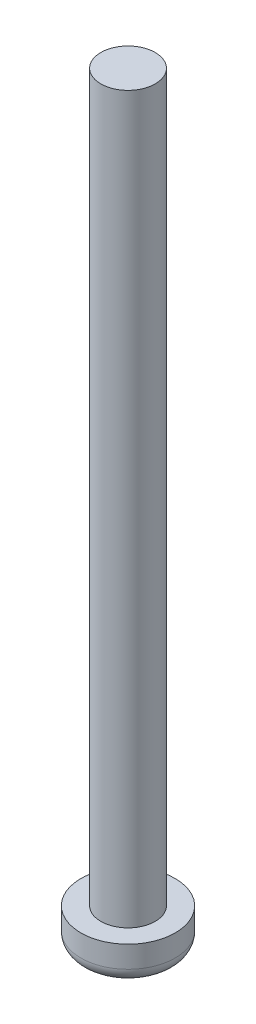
ISO-10303-21;
HEADER;
FILE_DESCRIPTION(('STEP AP214'),'2;1');
FILE_NAME('part.step','',(''),(''),'','','');
FILE_SCHEMA(('AUTOMOTIVE_DESIGN { 1 0 10303 214 1 1 1 1 }'));
ENDSEC;
DATA;
#1=APPLICATION_CONTEXT('core data for automotive mechanical design processes');
#2=APPLICATION_PROTOCOL_DEFINITION('international standard','automotive_design',2000,#1);
#3=PRODUCT_CONTEXT('',#1,'mechanical');
#4=PRODUCT('Part','Part','',(#3));
#5=PRODUCT_RELATED_PRODUCT_CATEGORY('part','',(#4));
#6=PRODUCT_DEFINITION_FORMATION('','',#4);
#7=PRODUCT_DEFINITION_CONTEXT('part definition',#1,'design');
#8=PRODUCT_DEFINITION('design','',#6,#7);
#9=PRODUCT_DEFINITION_SHAPE('','',#8);
#10=(LENGTH_UNIT() NAMED_UNIT(*) SI_UNIT(.MILLI.,.METRE.));
#11=(NAMED_UNIT(*) PLANE_ANGLE_UNIT() SI_UNIT($,.RADIAN.));
#12=(NAMED_UNIT(*) SI_UNIT($,.STERADIAN.) SOLID_ANGLE_UNIT());
#13=UNCERTAINTY_MEASURE_WITH_UNIT(LENGTH_MEASURE(1.E-05),#10,'distance_accuracy_value','');
#14=(GEOMETRIC_REPRESENTATION_CONTEXT(3) GLOBAL_UNCERTAINTY_ASSIGNED_CONTEXT((#13)) GLOBAL_UNIT_ASSIGNED_CONTEXT((#10,
#11,#12)) REPRESENTATION_CONTEXT('',''));
#15=CARTESIAN_POINT('',(0.,0.,0.));
#16=DIRECTION('',(0.,0.,1.));
#17=DIRECTION('',(1.,0.,0.));
#18=AXIS2_PLACEMENT_3D('',#15,#16,#17);
#19=CARTESIAN_POINT('',(0.,127.,0.));
#20=DIRECTION('',(0.,-1.,0.));
#21=DIRECTION('',(0.,0.,-1.));
#22=AXIS2_PLACEMENT_3D('',#19,#20,#21);
#23=CYLINDRICAL_SURFACE('',#22,4.7625);
#24=CARTESIAN_POINT('',(0.,127.,0.));
#25=DIRECTION('',(0.,1.,0.));
#26=DIRECTION('',(0.,0.,1.));
#27=AXIS2_PLACEMENT_3D('',#24,#25,#26);
#28=CIRCLE('',#27,4.7625);
#29=CARTESIAN_POINT('',(0.,127.,4.7625));
#30=VERTEX_POINT('',#29);
#31=EDGE_CURVE('E35',#30,#30,#28,.T.);
#32=ORIENTED_EDGE('',*,*,#31,.F.);
#33=EDGE_LOOP('',(#32));
#34=FACE_BOUND('',#33,.T.);
#35=CARTESIAN_POINT('',(0.,0.,0.));
#36=DIRECTION('',(0.,-1.,0.));
#37=DIRECTION('',(0.,0.,-1.));
#38=AXIS2_PLACEMENT_3D('',#35,#36,#37);
#39=CIRCLE('',#38,4.7625);
#40=CARTESIAN_POINT('',(0.,0.,-4.7625));
#41=VERTEX_POINT('',#40);
#42=EDGE_CURVE('E39',#41,#41,#39,.T.);
#43=ORIENTED_EDGE('',*,*,#42,.F.);
#44=EDGE_LOOP('',(#43));
#45=FACE_BOUND('',#44,.T.);
#46=ADVANCED_FACE('F25',(#34,#45),#23,.T.);
#47=CARTESIAN_POINT('',(0.,127.,0.));
#48=DIRECTION('',(0.,1.,0.));
#49=DIRECTION('',(0.,0.,1.));
#50=AXIS2_PLACEMENT_3D('',#47,#48,#49);
#51=PLANE('',#50);
#52=ORIENTED_EDGE('',*,*,#31,.T.);
#53=EDGE_LOOP('',(#52));
#54=FACE_BOUND('',#53,.T.);
#55=ADVANCED_FACE('F53',(#54),#51,.T.);
#56=CARTESIAN_POINT('',(0.,0.,0.));
#57=DIRECTION('',(0.,-1.,0.));
#58=DIRECTION('',(0.,0.,-1.));
#59=AXIS2_PLACEMENT_3D('',#56,#57,#58);
#60=PLANE('',#59);
#61=CARTESIAN_POINT('',(0.,0.,0.));
#62=DIRECTION('',(0.,-1.,0.));
#63=DIRECTION('',(0.,0.,-1.));
#64=AXIS2_PLACEMENT_3D('',#61,#62,#63);
#65=CIRCLE('',#64,8.255);
#66=CARTESIAN_POINT('',(0.,0.,-8.255));
#67=VERTEX_POINT('',#66);
#68=EDGE_CURVE('E44',#67,#67,#65,.T.);
#69=ORIENTED_EDGE('',*,*,#68,.F.);
#70=EDGE_LOOP('',(#69));
#71=FACE_BOUND('',#70,.T.);
#72=ORIENTED_EDGE('',*,*,#42,.T.);
#73=EDGE_LOOP('',(#72));
#74=FACE_BOUND('',#73,.T.);
#75=ADVANCED_FACE('F50',(#71,#74),#60,.F.);
#76=CARTESIAN_POINT('',(0.,-6.35,0.));
#77=DIRECTION('',(0.,1.,0.));
#78=DIRECTION('',(0.,0.,1.));
#79=AXIS2_PLACEMENT_3D('',#76,#77,#78);
#80=CYLINDRICAL_SURFACE('',#79,8.255);
#81=CARTESIAN_POINT('',(0.,-3.81,0.));
#82=DIRECTION('',(0.,-1.,0.));
#83=DIRECTION('',(0.,0.,-1.));
#84=AXIS2_PLACEMENT_3D('',#81,#82,#83);
#85=CIRCLE('',#84,8.255);
#86=CARTESIAN_POINT('',(0.,-3.81,-8.255));
#87=VERTEX_POINT('',#86);
#88=EDGE_CURVE('E10',#87,#87,#85,.F.);
#89=ORIENTED_EDGE('',*,*,#88,.T.);
#90=EDGE_LOOP('',(#89));
#91=FACE_BOUND('',#90,.T.);
#92=ORIENTED_EDGE('',*,*,#68,.T.);
#93=EDGE_LOOP('',(#92));
#94=FACE_BOUND('',#93,.T.);
#95=ADVANCED_FACE('F48',(#91,#94),#80,.T.);
#96=CARTESIAN_POINT('',(0.,-6.35,0.));
#97=DIRECTION('',(0.,-1.,0.));
#98=DIRECTION('',(0.,0.,-1.));
#99=AXIS2_PLACEMENT_3D('',#96,#97,#98);
#100=PLANE('',#99);
#101=CARTESIAN_POINT('',(0.,-6.35,0.));
#102=DIRECTION('',(0.,-1.,0.));
#103=DIRECTION('',(0.,0.,-1.));
#104=AXIS2_PLACEMENT_3D('',#101,#102,#103);
#105=CIRCLE('',#104,5.715);
#106=CARTESIAN_POINT('',(0.,-6.35,-5.715));
#107=VERTEX_POINT('',#106);
#108=EDGE_CURVE('E31',#107,#107,#105,.T.);
#109=ORIENTED_EDGE('',*,*,#108,.T.);
#110=EDGE_LOOP('',(#109));
#111=FACE_BOUND('',#110,.T.);
#112=ADVANCED_FACE('F69',(#111),#100,.T.);
#113=CARTESIAN_POINT('',(0.,-3.81,0.));
#114=DIRECTION('',(0.,-1.,0.));
#115=DIRECTION('',(0.,0.,-1.));
#116=AXIS2_PLACEMENT_3D('',#113,#114,#115);
#117=TOROIDAL_SURFACE('',#116,5.715,2.54);
#118=ORIENTED_EDGE('',*,*,#88,.F.);
#119=EDGE_LOOP('',(#118));
#120=FACE_BOUND('',#119,.T.);
#121=ORIENTED_EDGE('',*,*,#108,.F.);
#122=EDGE_LOOP('',(#121));
#123=FACE_BOUND('',#122,.T.);
#124=ADVANCED_FACE('F71',(#120,#123),#117,.T.);
#125=CLOSED_SHELL('',(#46,#55,#75,#95,#112,#124));
#126=MANIFOLD_SOLID_BREP('B2',#125);
#127=ADVANCED_BREP_SHAPE_REPRESENTATION('',(#18,#126),#14);
#128=SHAPE_DEFINITION_REPRESENTATION(#9,#127);
ENDSEC;
END-ISO-10303-21;
